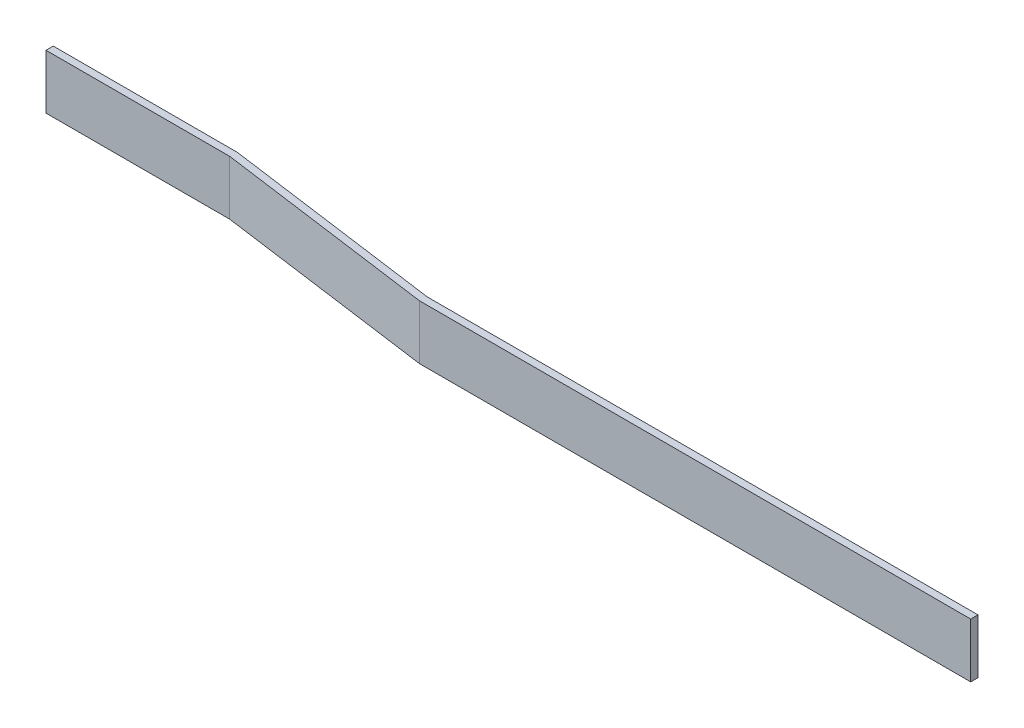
ISO-10303-21;
HEADER;
FILE_DESCRIPTION(('STEP AP214'),'2;1');
FILE_NAME('part.step','',(''),(''),'','','');
FILE_SCHEMA(('AUTOMOTIVE_DESIGN { 1 0 10303 214 1 1 1 1 }'));
ENDSEC;
DATA;
#1=APPLICATION_CONTEXT('core data for automotive mechanical design processes');
#2=APPLICATION_PROTOCOL_DEFINITION('international standard','automotive_design',2000,#1);
#3=PRODUCT_CONTEXT('',#1,'mechanical');
#4=PRODUCT('Part','Part','',(#3));
#5=PRODUCT_RELATED_PRODUCT_CATEGORY('part','',(#4));
#6=PRODUCT_DEFINITION_FORMATION('','',#4);
#7=PRODUCT_DEFINITION_CONTEXT('part definition',#1,'design');
#8=PRODUCT_DEFINITION('design','',#6,#7);
#9=PRODUCT_DEFINITION_SHAPE('','',#8);
#10=(LENGTH_UNIT() NAMED_UNIT(*) SI_UNIT(.MILLI.,.METRE.));
#11=(NAMED_UNIT(*) PLANE_ANGLE_UNIT() SI_UNIT($,.RADIAN.));
#12=(NAMED_UNIT(*) SI_UNIT($,.STERADIAN.) SOLID_ANGLE_UNIT());
#13=UNCERTAINTY_MEASURE_WITH_UNIT(LENGTH_MEASURE(1.E-05),#10,'distance_accuracy_value','');
#14=(GEOMETRIC_REPRESENTATION_CONTEXT(3) GLOBAL_UNCERTAINTY_ASSIGNED_CONTEXT((#13)) GLOBAL_UNIT_ASSIGNED_CONTEXT((#10,
#11,#12)) REPRESENTATION_CONTEXT('',''));
#15=CARTESIAN_POINT('',(0.,0.,0.));
#16=DIRECTION('',(0.,0.,1.));
#17=DIRECTION('',(1.,0.,0.));
#18=AXIS2_PLACEMENT_3D('',#15,#16,#17);
#19=CARTESIAN_POINT('',(37.5294237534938,15.,-2.99106960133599));
#20=DIRECTION('',(0.,0.,-1.));
#21=DIRECTION('',(-1.,0.,0.));
#22=AXIS2_PLACEMENT_3D('',#19,#20,#21);
#23=PLANE('',#22);
#24=DIRECTION('',(1.,0.,0.));
#25=VECTOR('',#24,1.);
#26=CARTESIAN_POINT('',(37.5294237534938,0.,-2.99106960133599));
#27=LINE('',#26,#25);
#28=CARTESIAN_POINT('',(37.5294237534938,0.,-2.99106960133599));
#29=VERTEX_POINT('',#28);
#30=CARTESIAN_POINT('',(189.40279507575,0.,-2.99106960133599));
#31=VERTEX_POINT('',#30);
#32=EDGE_CURVE('E130',#29,#31,#27,.T.);
#33=ORIENTED_EDGE('',*,*,#32,.T.);
#34=DIRECTION('',(0.,-1.,0.));
#35=VECTOR('',#34,1.);
#36=CARTESIAN_POINT('',(189.40279507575,15.,-2.99106960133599));
#37=LINE('',#36,#35);
#38=CARTESIAN_POINT('',(189.40279507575,15.,-2.99106960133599));
#39=VERTEX_POINT('',#38);
#40=EDGE_CURVE('E11',#39,#31,#37,.T.);
#41=ORIENTED_EDGE('',*,*,#40,.F.);
#42=DIRECTION('',(1.,0.,0.));
#43=VECTOR('',#42,1.);
#44=CARTESIAN_POINT('',(37.5294237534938,15.,-2.99106960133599));
#45=LINE('',#44,#43);
#46=CARTESIAN_POINT('',(37.5294237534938,15.,-2.99106960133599));
#47=VERTEX_POINT('',#46);
#48=EDGE_CURVE('E88',#47,#39,#45,.T.);
#49=ORIENTED_EDGE('',*,*,#48,.F.);
#50=DIRECTION('',(0.,-1.,0.));
#51=VECTOR('',#50,1.);
#52=CARTESIAN_POINT('',(37.5294237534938,15.,-2.99106960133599));
#53=LINE('',#52,#51);
#54=EDGE_CURVE('E129',#47,#29,#53,.T.);
#55=ORIENTED_EDGE('',*,*,#54,.T.);
#56=EDGE_LOOP('',(#33,#41,#49,#55));
#57=FACE_BOUND('',#56,.T.);
#58=ADVANCED_FACE('F33',(#57),#23,.F.);
#59=CARTESIAN_POINT('',(189.40279507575,15.,-4.99106960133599));
#60=DIRECTION('',(1.,0.,0.));
#61=DIRECTION('',(0.,0.,-1.));
#62=AXIS2_PLACEMENT_3D('',#59,#60,#61);
#63=PLANE('',#62);
#64=DIRECTION('',(0.,0.,1.));
#65=VECTOR('',#64,1.);
#66=CARTESIAN_POINT('',(189.40279507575,0.,-4.99106960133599));
#67=LINE('',#66,#65);
#68=CARTESIAN_POINT('',(189.40279507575,0.,-4.99106960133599));
#69=VERTEX_POINT('',#68);
#70=EDGE_CURVE('E133',#69,#31,#67,.T.);
#71=ORIENTED_EDGE('',*,*,#70,.F.);
#72=DIRECTION('',(0.,-1.,0.));
#73=VECTOR('',#72,1.);
#74=CARTESIAN_POINT('',(189.40279507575,15.,-4.99106960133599));
#75=LINE('',#74,#73);
#76=CARTESIAN_POINT('',(189.40279507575,15.,-4.99106960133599));
#77=VERTEX_POINT('',#76);
#78=EDGE_CURVE('E41',#77,#69,#75,.T.);
#79=ORIENTED_EDGE('',*,*,#78,.F.);
#80=DIRECTION('',(0.,0.,1.));
#81=VECTOR('',#80,1.);
#82=CARTESIAN_POINT('',(189.40279507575,15.,-4.99106960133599));
#83=LINE('',#82,#81);
#84=EDGE_CURVE('E172',#77,#39,#83,.T.);
#85=ORIENTED_EDGE('',*,*,#84,.T.);
#86=ORIENTED_EDGE('',*,*,#40,.T.);
#87=EDGE_LOOP('',(#71,#79,#85,#86));
#88=FACE_BOUND('',#87,.T.);
#89=ADVANCED_FACE('F163',(#88),#63,.T.);
#90=CARTESIAN_POINT('',(37.5294237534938,15.,-4.99106960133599));
#91=DIRECTION('',(0.,0.,-1.));
#92=DIRECTION('',(-1.,0.,0.));
#93=AXIS2_PLACEMENT_3D('',#90,#91,#92);
#94=PLANE('',#93);
#95=DIRECTION('',(1.,0.,0.));
#96=VECTOR('',#95,1.);
#97=CARTESIAN_POINT('',(37.5294237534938,0.,-4.99106960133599));
#98=LINE('',#97,#96);
#99=CARTESIAN_POINT('',(37.6661717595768,0.,-4.99106960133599));
#100=VERTEX_POINT('',#99);
#101=EDGE_CURVE('E136',#100,#69,#98,.T.);
#102=ORIENTED_EDGE('',*,*,#101,.F.);
#103=DIRECTION('',(0.,-1.,0.));
#104=VECTOR('',#103,1.);
#105=CARTESIAN_POINT('',(37.6661717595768,15.,-4.99106960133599));
#106=LINE('',#105,#104);
#107=CARTESIAN_POINT('',(37.6661717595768,15.,-4.99106960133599));
#108=VERTEX_POINT('',#107);
#109=EDGE_CURVE('E153',#108,#100,#106,.T.);
#110=ORIENTED_EDGE('',*,*,#109,.F.);
#111=DIRECTION('',(1.,0.,0.));
#112=VECTOR('',#111,1.);
#113=CARTESIAN_POINT('',(37.5294237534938,15.,-4.99106960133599));
#114=LINE('',#113,#112);
#115=EDGE_CURVE('E160',#108,#77,#114,.T.);
#116=ORIENTED_EDGE('',*,*,#115,.T.);
#117=ORIENTED_EDGE('',*,*,#78,.T.);
#118=EDGE_LOOP('',(#102,#110,#116,#117));
#119=FACE_BOUND('',#118,.T.);
#120=ADVANCED_FACE('F158',(#119),#94,.T.);
#121=CARTESIAN_POINT('',(-22.7628963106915,15.,-13.2934377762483));
#122=DIRECTION('',(0.136111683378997,0.,-0.990693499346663));
#123=DIRECTION('',(-0.990693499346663,0.,-0.136111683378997));
#124=AXIS2_PLACEMENT_3D('',#121,#122,#123);
#125=PLANE('',#124);
#126=DIRECTION('',(0.990693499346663,0.,0.136111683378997));
#127=VECTOR('',#126,1.);
#128=CARTESIAN_POINT('',(-22.7628963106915,0.,-13.2934377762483));
#129=LINE('',#128,#127);
#130=CARTESIAN_POINT('',(-22.8983716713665,0.,-13.312050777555));
#131=VERTEX_POINT('',#130);
#132=EDGE_CURVE('E139',#131,#100,#129,.T.);
#133=ORIENTED_EDGE('',*,*,#132,.F.);
#134=DIRECTION('',(0.,-1.,0.));
#135=VECTOR('',#134,1.);
#136=CARTESIAN_POINT('',(-22.8983716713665,15.,-13.312050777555));
#137=LINE('',#136,#135);
#138=CARTESIAN_POINT('',(-22.8983716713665,15.,-13.312050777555));
#139=VERTEX_POINT('',#138);
#140=EDGE_CURVE('E151',#139,#131,#137,.T.);
#141=ORIENTED_EDGE('',*,*,#140,.F.);
#142=DIRECTION('',(0.990693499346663,0.,0.136111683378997));
#143=VECTOR('',#142,1.);
#144=CARTESIAN_POINT('',(-22.7628963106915,15.,-13.2934377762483));
#145=LINE('',#144,#143);
#146=EDGE_CURVE('E124',#139,#108,#145,.T.);
#147=ORIENTED_EDGE('',*,*,#146,.T.);
#148=ORIENTED_EDGE('',*,*,#109,.T.);
#149=EDGE_LOOP('',(#133,#141,#147,#148));
#150=FACE_BOUND('',#149,.T.);
#151=ADVANCED_FACE('F170',(#150),#125,.T.);
#152=CARTESIAN_POINT('',(-73.6461742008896,15.,-13.312050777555));
#153=DIRECTION('',(0.,0.,-1.));
#154=DIRECTION('',(-1.,0.,0.));
#155=AXIS2_PLACEMENT_3D('',#152,#153,#154);
#156=PLANE('',#155);
#157=DIRECTION('',(1.,0.,0.));
#158=VECTOR('',#157,1.);
#159=CARTESIAN_POINT('',(-73.6461742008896,0.,-13.312050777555));
#160=LINE('',#159,#158);
#161=CARTESIAN_POINT('',(-73.6461742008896,0.,-13.312050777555));
#162=VERTEX_POINT('',#161);
#163=EDGE_CURVE('E142',#162,#131,#160,.T.);
#164=ORIENTED_EDGE('',*,*,#163,.F.);
#165=DIRECTION('',(0.,-1.,0.));
#166=VECTOR('',#165,1.);
#167=CARTESIAN_POINT('',(-73.6461742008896,15.,-13.312050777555));
#168=LINE('',#167,#166);
#169=CARTESIAN_POINT('',(-73.6461742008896,15.,-13.312050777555));
#170=VERTEX_POINT('',#169);
#171=EDGE_CURVE('E112',#170,#162,#168,.T.);
#172=ORIENTED_EDGE('',*,*,#171,.F.);
#173=DIRECTION('',(1.,0.,0.));
#174=VECTOR('',#173,1.);
#175=CARTESIAN_POINT('',(-73.6461742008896,15.,-13.312050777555));
#176=LINE('',#175,#174);
#177=EDGE_CURVE('E122',#170,#139,#176,.T.);
#178=ORIENTED_EDGE('',*,*,#177,.T.);
#179=ORIENTED_EDGE('',*,*,#140,.T.);
#180=EDGE_LOOP('',(#164,#172,#178,#179));
#181=FACE_BOUND('',#180,.T.);
#182=ADVANCED_FACE('F177',(#181),#156,.T.);
#183=CARTESIAN_POINT('',(-73.6461742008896,15.,-11.312050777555));
#184=DIRECTION('',(-1.,0.,0.));
#185=DIRECTION('',(0.,0.,1.));
#186=AXIS2_PLACEMENT_3D('',#183,#184,#185);
#187=PLANE('',#186);
#188=DIRECTION('',(0.,0.,-1.));
#189=VECTOR('',#188,1.);
#190=CARTESIAN_POINT('',(-73.6461742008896,0.,-11.312050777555));
#191=LINE('',#190,#189);
#192=CARTESIAN_POINT('',(-73.6461742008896,0.,-11.312050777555));
#193=VERTEX_POINT('',#192);
#194=EDGE_CURVE('E111',#193,#162,#191,.T.);
#195=ORIENTED_EDGE('',*,*,#194,.F.);
#196=DIRECTION('',(0.,-1.,0.));
#197=VECTOR('',#196,1.);
#198=CARTESIAN_POINT('',(-73.6461742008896,15.,-11.312050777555));
#199=LINE('',#198,#197);
#200=CARTESIAN_POINT('',(-73.6461742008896,15.,-11.312050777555));
#201=VERTEX_POINT('',#200);
#202=EDGE_CURVE('E105',#201,#193,#199,.T.);
#203=ORIENTED_EDGE('',*,*,#202,.F.);
#204=DIRECTION('',(0.,0.,-1.));
#205=VECTOR('',#204,1.);
#206=CARTESIAN_POINT('',(-73.6461742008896,15.,-11.312050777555));
#207=LINE('',#206,#205);
#208=EDGE_CURVE('E109',#201,#170,#207,.T.);
#209=ORIENTED_EDGE('',*,*,#208,.T.);
#210=ORIENTED_EDGE('',*,*,#171,.T.);
#211=EDGE_LOOP('',(#195,#203,#209,#210));
#212=FACE_BOUND('',#211,.T.);
#213=ADVANCED_FACE('F107',(#212),#187,.T.);
#214=CARTESIAN_POINT('',(-73.6461742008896,15.,-11.312050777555));
#215=DIRECTION('',(0.,0.,-1.));
#216=DIRECTION('',(-1.,0.,0.));
#217=AXIS2_PLACEMENT_3D('',#214,#215,#216);
#218=PLANE('',#217);
#219=DIRECTION('',(1.,0.,0.));
#220=VECTOR('',#219,1.);
#221=CARTESIAN_POINT('',(-73.6461742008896,0.,-11.312050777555));
#222=LINE('',#221,#220);
#223=CARTESIAN_POINT('',(-23.0351196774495,0.,-11.312050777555));
#224=VERTEX_POINT('',#223);
#225=EDGE_CURVE('E76',#193,#224,#222,.T.);
#226=ORIENTED_EDGE('',*,*,#225,.T.);
#227=DIRECTION('',(0.,-1.,0.));
#228=VECTOR('',#227,1.);
#229=CARTESIAN_POINT('',(-23.0351196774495,15.,-11.312050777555));
#230=LINE('',#229,#228);
#231=CARTESIAN_POINT('',(-23.0351196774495,15.,-11.312050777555));
#232=VERTEX_POINT('',#231);
#233=EDGE_CURVE('E113',#232,#224,#230,.T.);
#234=ORIENTED_EDGE('',*,*,#233,.F.);
#235=DIRECTION('',(1.,0.,0.));
#236=VECTOR('',#235,1.);
#237=CARTESIAN_POINT('',(-73.6461742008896,15.,-11.312050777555));
#238=LINE('',#237,#236);
#239=EDGE_CURVE('E115',#201,#232,#238,.T.);
#240=ORIENTED_EDGE('',*,*,#239,.F.);
#241=ORIENTED_EDGE('',*,*,#202,.T.);
#242=EDGE_LOOP('',(#226,#234,#240,#241));
#243=FACE_BOUND('',#242,.T.);
#244=ADVANCED_FACE('F116',(#243),#218,.F.);
#245=CARTESIAN_POINT('',(-23.0351196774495,15.,-11.312050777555));
#246=DIRECTION('',(0.136111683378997,0.,-0.990693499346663));
#247=DIRECTION('',(-0.990693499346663,0.,-0.136111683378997));
#248=AXIS2_PLACEMENT_3D('',#245,#246,#247);
#249=PLANE('',#248);
#250=DIRECTION('',(0.990693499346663,0.,0.136111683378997));
#251=VECTOR('',#250,1.);
#252=CARTESIAN_POINT('',(-23.0351196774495,0.,-11.312050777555));
#253=LINE('',#252,#251);
#254=EDGE_CURVE('E82',#224,#29,#253,.T.);
#255=ORIENTED_EDGE('',*,*,#254,.T.);
#256=ORIENTED_EDGE('',*,*,#54,.F.);
#257=DIRECTION('',(0.990693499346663,0.,0.136111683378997));
#258=VECTOR('',#257,1.);
#259=CARTESIAN_POINT('',(-23.0351196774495,15.,-11.312050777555));
#260=LINE('',#259,#258);
#261=EDGE_CURVE('E49',#232,#47,#260,.T.);
#262=ORIENTED_EDGE('',*,*,#261,.F.);
#263=ORIENTED_EDGE('',*,*,#233,.T.);
#264=EDGE_LOOP('',(#255,#256,#262,#263));
#265=FACE_BOUND('',#264,.T.);
#266=ADVANCED_FACE('F179',(#265),#249,.F.);
#267=CARTESIAN_POINT('',(189.40279507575,15.,-2.99106960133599));
#268=DIRECTION('',(0.,-1.,0.));
#269=DIRECTION('',(-1.,0.,0.));
#270=AXIS2_PLACEMENT_3D('',#267,#268,#269);
#271=PLANE('',#270);
#272=ORIENTED_EDGE('',*,*,#48,.T.);
#273=ORIENTED_EDGE('',*,*,#84,.F.);
#274=ORIENTED_EDGE('',*,*,#115,.F.);
#275=ORIENTED_EDGE('',*,*,#146,.F.);
#276=ORIENTED_EDGE('',*,*,#177,.F.);
#277=ORIENTED_EDGE('',*,*,#208,.F.);
#278=ORIENTED_EDGE('',*,*,#239,.T.);
#279=ORIENTED_EDGE('',*,*,#261,.T.);
#280=EDGE_LOOP('',(#272,#273,#274,#275,#276,#277,#278,#279));
#281=FACE_BOUND('',#280,.T.);
#282=ADVANCED_FACE('F119',(#281),#271,.F.);
#283=CARTESIAN_POINT('',(189.40279507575,0.,-2.99106960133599));
#284=DIRECTION('',(0.,-1.,0.));
#285=DIRECTION('',(-1.,0.,0.));
#286=AXIS2_PLACEMENT_3D('',#283,#284,#285);
#287=PLANE('',#286);
#288=ORIENTED_EDGE('',*,*,#32,.F.);
#289=ORIENTED_EDGE('',*,*,#254,.F.);
#290=ORIENTED_EDGE('',*,*,#225,.F.);
#291=ORIENTED_EDGE('',*,*,#194,.T.);
#292=ORIENTED_EDGE('',*,*,#163,.T.);
#293=ORIENTED_EDGE('',*,*,#132,.T.);
#294=ORIENTED_EDGE('',*,*,#101,.T.);
#295=ORIENTED_EDGE('',*,*,#70,.T.);
#296=EDGE_LOOP('',(#288,#289,#290,#291,#292,#293,#294,#295));
#297=FACE_BOUND('',#296,.T.);
#298=ADVANCED_FACE('F166',(#297),#287,.T.);
#299=CLOSED_SHELL('',(#58,#89,#120,#151,#182,#213,#244,#266,#282,#298));
#300=MANIFOLD_SOLID_BREP('B2',#299);
#301=ADVANCED_BREP_SHAPE_REPRESENTATION('',(#18,#300),#14);
#302=SHAPE_DEFINITION_REPRESENTATION(#9,#301);
ENDSEC;
END-ISO-10303-21;
